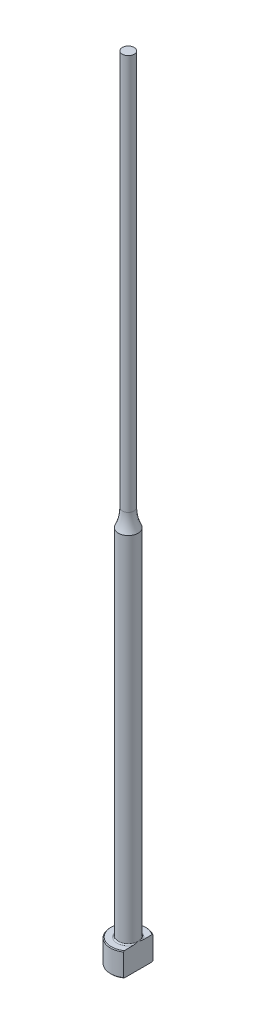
from build123d import *
from build123d.topology import SkipClean

# Parameters (mm, degrees)
CHAMFER1_SIZE    = 0.2
FILLET1_R        = 0.3
KEYED_HEAD_DEPTH = 201.101224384


with BuildPart() as part:
    # Sketch1 → Revolve1 (revolve)
    with BuildSketch(Plane.XY, mode=Mode.PRIVATE) as revolve1_sk:
        with BuildLine():
            Line((0, 0), (-4.5, 0))
            Line((-4.5, 0), (-4.5, 6))
            Line((-4.5, 6), (-2.5, 6))
            Line((-2.5, 6), (-2.5, 95.641101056))
            ThreePointArc((-2.5, 95.641101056), (-1.753205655, 97.763932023), (-1.5, 100))
            Line((-1.5, 100), (-1.5, 200))
            Line((-1.5, 200), (0, 200))
            Line((0, 200), (0, 0))
        make_face()
    revolve(revolve1_sk.sketch.rotate(Axis((0, 259.958771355, 0), (0, -1, 0)), 270), axis=Axis((0, 259.958771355, 0), (0, -1, 0)))

    # Chamfer1
    chamfer1_edges = [part.edges().sort_by_distance(p)[0] for p in [
        (0, 0, -4.5),
        (0, 6, -4.5),
    ]]
    chamfer(chamfer1_edges, length=CHAMFER1_SIZE)

    # Fillet1
    fillet1_edges = [part.edges().sort_by_distance(p)[0] for p in [
        (0, 6, -2.5),
    ]]
    fillet(fillet1_edges, radius=FILLET1_R)

    # Sketch2 → Keyed Head (cut, through all)
    with SkipClean():  # the faces are left unmerged after this step: merging them gives an invalid solid
        with BuildSketch(Plane(origin=(0, 0, 0), x_dir=(1, 0, 0), z_dir=(0, 1, 0))):
            with BuildLine():
                Line((2.5, -3.741657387), (2.5, 3.741657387))
                ThreePointArc((2.5, 3.741657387), (4.5, 0), (2.5, -3.741657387))
            make_face()
        extrude(amount=KEYED_HEAD_DEPTH, mode=Mode.SUBTRACT)


solid = part.part
